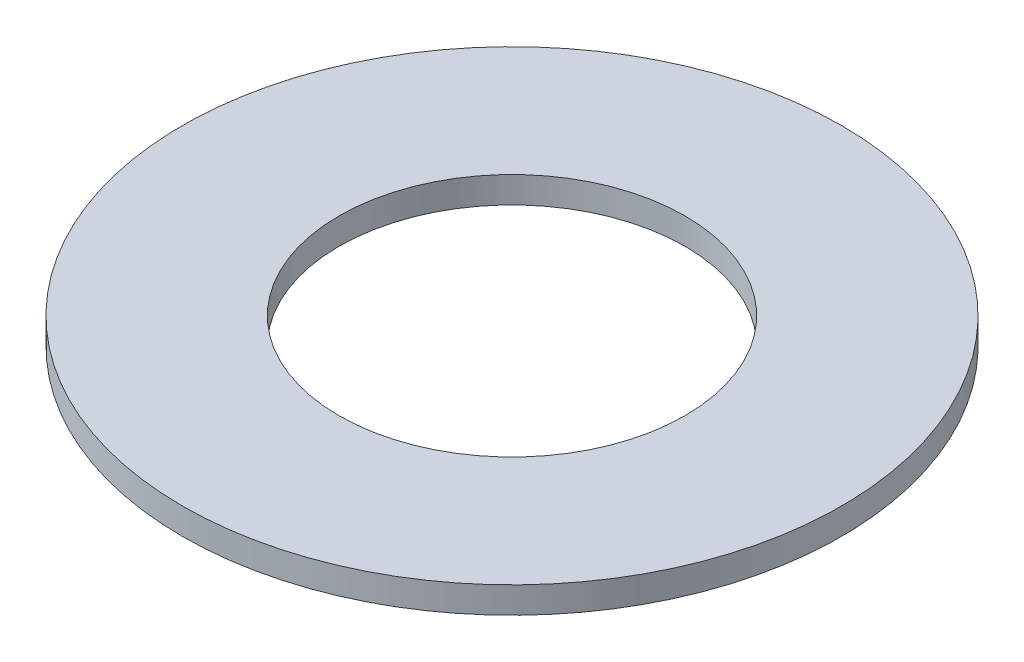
ISO-10303-21;
HEADER;
FILE_DESCRIPTION(('STEP AP214'),'2;1');
FILE_NAME('part.step','',(''),(''),'','','');
FILE_SCHEMA(('AUTOMOTIVE_DESIGN { 1 0 10303 214 1 1 1 1 }'));
ENDSEC;
DATA;
#1=APPLICATION_CONTEXT('core data for automotive mechanical design processes');
#2=APPLICATION_PROTOCOL_DEFINITION('international standard','automotive_design',2000,#1);
#3=PRODUCT_CONTEXT('',#1,'mechanical');
#4=PRODUCT('Part','Part','',(#3));
#5=PRODUCT_RELATED_PRODUCT_CATEGORY('part','',(#4));
#6=PRODUCT_DEFINITION_FORMATION('','',#4);
#7=PRODUCT_DEFINITION_CONTEXT('part definition',#1,'design');
#8=PRODUCT_DEFINITION('design','',#6,#7);
#9=PRODUCT_DEFINITION_SHAPE('','',#8);
#10=(LENGTH_UNIT() NAMED_UNIT(*) SI_UNIT(.MILLI.,.METRE.));
#11=(NAMED_UNIT(*) PLANE_ANGLE_UNIT() SI_UNIT($,.RADIAN.));
#12=(NAMED_UNIT(*) SI_UNIT($,.STERADIAN.) SOLID_ANGLE_UNIT());
#13=UNCERTAINTY_MEASURE_WITH_UNIT(LENGTH_MEASURE(1.E-05),#10,'distance_accuracy_value','');
#14=(GEOMETRIC_REPRESENTATION_CONTEXT(3) GLOBAL_UNCERTAINTY_ASSIGNED_CONTEXT((#13)) GLOBAL_UNIT_ASSIGNED_CONTEXT((#10,
#11,#12)) REPRESENTATION_CONTEXT('',''));
#15=CARTESIAN_POINT('',(0.,0.,0.));
#16=DIRECTION('',(0.,0.,1.));
#17=DIRECTION('',(1.,0.,0.));
#18=AXIS2_PLACEMENT_3D('',#15,#16,#17);
#19=CARTESIAN_POINT('',(0.,0.8,0.));
#20=DIRECTION('',(0.,1.,0.));
#21=DIRECTION('',(0.,0.,1.));
#22=AXIS2_PLACEMENT_3D('',#19,#20,#21);
#23=PLANE('',#22);
#24=CARTESIAN_POINT('',(0.,0.8,0.));
#25=DIRECTION('',(0.,1.,0.));
#26=DIRECTION('',(0.,0.,1.));
#27=AXIS2_PLACEMENT_3D('',#24,#25,#26);
#28=CIRCLE('',#27,10.);
#29=CARTESIAN_POINT('',(0.,0.8,10.));
#30=VERTEX_POINT('',#29);
#31=EDGE_CURVE('E10',#30,#30,#28,.T.);
#32=ORIENTED_EDGE('',*,*,#31,.T.);
#33=EDGE_LOOP('',(#32));
#34=FACE_BOUND('',#33,.T.);
#35=CARTESIAN_POINT('',(0.,0.8,0.));
#36=DIRECTION('',(0.,1.,0.));
#37=DIRECTION('',(0.,0.,1.));
#38=AXIS2_PLACEMENT_3D('',#35,#36,#37);
#39=CIRCLE('',#38,5.25);
#40=CARTESIAN_POINT('',(0.,0.8,5.25));
#41=VERTEX_POINT('',#40);
#42=EDGE_CURVE('E43',#41,#41,#39,.T.);
#43=ORIENTED_EDGE('',*,*,#42,.F.);
#44=EDGE_LOOP('',(#43));
#45=FACE_BOUND('',#44,.T.);
#46=ADVANCED_FACE('F32',(#34,#45),#23,.T.);
#47=CARTESIAN_POINT('',(0.,0.,0.));
#48=DIRECTION('',(0.,1.,0.));
#49=DIRECTION('',(0.,0.,1.));
#50=AXIS2_PLACEMENT_3D('',#47,#48,#49);
#51=PLANE('',#50);
#52=CARTESIAN_POINT('',(0.,0.,0.));
#53=DIRECTION('',(0.,1.,0.));
#54=DIRECTION('',(0.,0.,1.));
#55=AXIS2_PLACEMENT_3D('',#52,#53,#54);
#56=CIRCLE('',#55,10.);
#57=CARTESIAN_POINT('',(0.,0.,10.));
#58=VERTEX_POINT('',#57);
#59=EDGE_CURVE('E36',#58,#58,#56,.T.);
#60=ORIENTED_EDGE('',*,*,#59,.F.);
#61=EDGE_LOOP('',(#60));
#62=FACE_BOUND('',#61,.T.);
#63=CARTESIAN_POINT('',(0.,0.,0.));
#64=DIRECTION('',(0.,1.,0.));
#65=DIRECTION('',(0.,0.,1.));
#66=AXIS2_PLACEMENT_3D('',#63,#64,#65);
#67=CIRCLE('',#66,5.25);
#68=CARTESIAN_POINT('',(0.,0.,5.25));
#69=VERTEX_POINT('',#68);
#70=EDGE_CURVE('E45',#69,#69,#67,.T.);
#71=ORIENTED_EDGE('',*,*,#70,.T.);
#72=EDGE_LOOP('',(#71));
#73=FACE_BOUND('',#72,.T.);
#74=ADVANCED_FACE('F55',(#62,#73),#51,.F.);
#75=CARTESIAN_POINT('',(0.,0.8,0.));
#76=DIRECTION('',(0.,-1.,0.));
#77=DIRECTION('',(0.,0.,-1.));
#78=AXIS2_PLACEMENT_3D('',#75,#76,#77);
#79=CYLINDRICAL_SURFACE('',#78,10.);
#80=ORIENTED_EDGE('',*,*,#31,.F.);
#81=EDGE_LOOP('',(#80));
#82=FACE_BOUND('',#81,.T.);
#83=ORIENTED_EDGE('',*,*,#59,.T.);
#84=EDGE_LOOP('',(#83));
#85=FACE_BOUND('',#84,.T.);
#86=ADVANCED_FACE('F34',(#82,#85),#79,.T.);
#87=CARTESIAN_POINT('',(0.,0.8,0.));
#88=DIRECTION('',(0.,-1.,0.));
#89=DIRECTION('',(0.,0.,-1.));
#90=AXIS2_PLACEMENT_3D('',#87,#88,#89);
#91=CYLINDRICAL_SURFACE('',#90,5.25);
#92=ORIENTED_EDGE('',*,*,#42,.T.);
#93=EDGE_LOOP('',(#92));
#94=FACE_BOUND('',#93,.T.);
#95=ORIENTED_EDGE('',*,*,#70,.F.);
#96=EDGE_LOOP('',(#95));
#97=FACE_BOUND('',#96,.T.);
#98=ADVANCED_FACE('F51',(#94,#97),#91,.F.);
#99=CLOSED_SHELL('',(#46,#74,#86,#98));
#100=MANIFOLD_SOLID_BREP('B2',#99);
#101=ADVANCED_BREP_SHAPE_REPRESENTATION('',(#18,#100),#14);
#102=SHAPE_DEFINITION_REPRESENTATION(#9,#101);
ENDSEC;
END-ISO-10303-21;
